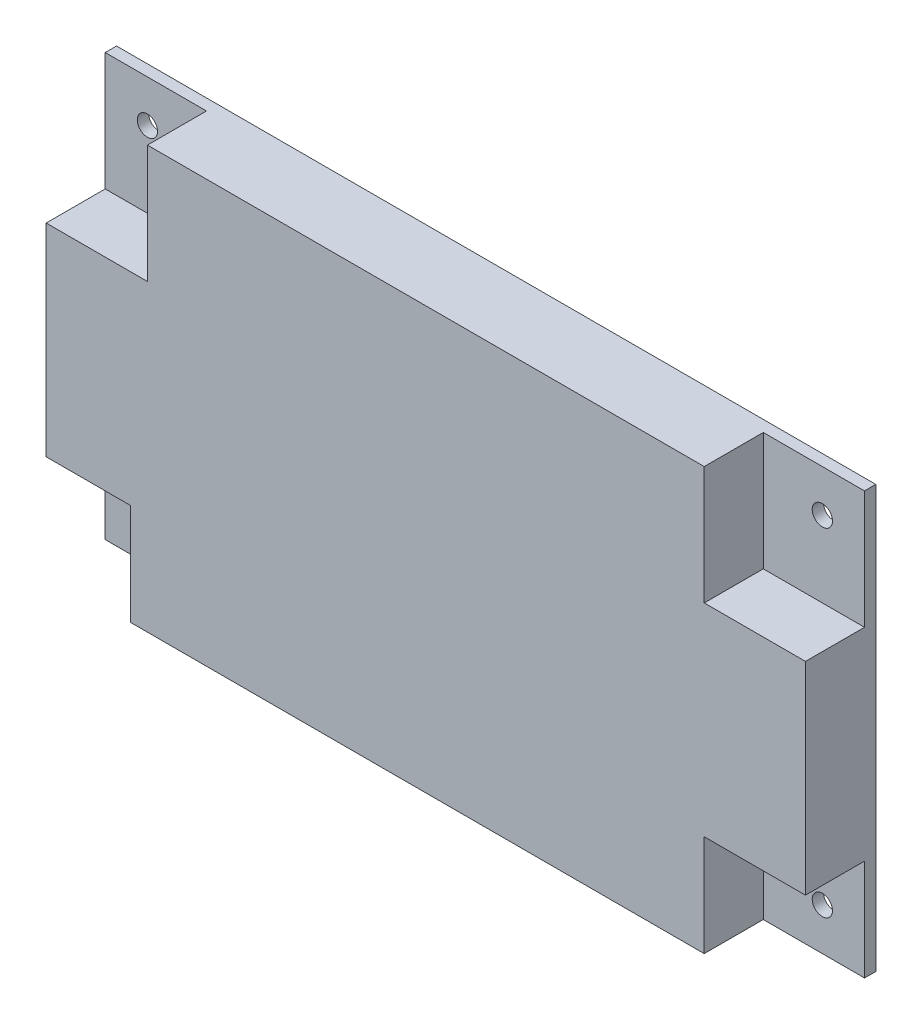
ISO-10303-21;
HEADER;
FILE_DESCRIPTION(('STEP AP214'),'2;1');
FILE_NAME('part.step','',(''),(''),'','','');
FILE_SCHEMA(('AUTOMOTIVE_DESIGN { 1 0 10303 214 1 1 1 1 }'));
ENDSEC;
DATA;
#1=APPLICATION_CONTEXT('core data for automotive mechanical design processes');
#2=APPLICATION_PROTOCOL_DEFINITION('international standard','automotive_design',2000,#1);
#3=PRODUCT_CONTEXT('',#1,'mechanical');
#4=PRODUCT('Part','Part','',(#3));
#5=PRODUCT_RELATED_PRODUCT_CATEGORY('part','',(#4));
#6=PRODUCT_DEFINITION_FORMATION('','',#4);
#7=PRODUCT_DEFINITION_CONTEXT('part definition',#1,'design');
#8=PRODUCT_DEFINITION('design','',#6,#7);
#9=PRODUCT_DEFINITION_SHAPE('','',#8);
#10=(LENGTH_UNIT() NAMED_UNIT(*) SI_UNIT(.MILLI.,.METRE.));
#11=(NAMED_UNIT(*) PLANE_ANGLE_UNIT() SI_UNIT($,.RADIAN.));
#12=(NAMED_UNIT(*) SI_UNIT($,.STERADIAN.) SOLID_ANGLE_UNIT());
#13=UNCERTAINTY_MEASURE_WITH_UNIT(LENGTH_MEASURE(1.E-05),#10,'distance_accuracy_value','');
#14=(GEOMETRIC_REPRESENTATION_CONTEXT(3) GLOBAL_UNCERTAINTY_ASSIGNED_CONTEXT((#13)) GLOBAL_UNIT_ASSIGNED_CONTEXT((#10,
#11,#12)) REPRESENTATION_CONTEXT('',''));
#15=CARTESIAN_POINT('',(0.,0.,0.));
#16=DIRECTION('',(0.,0.,1.));
#17=DIRECTION('',(1.,0.,0.));
#18=AXIS2_PLACEMENT_3D('',#15,#16,#17);
#19=CARTESIAN_POINT('',(2.22044604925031E-13,63.5000000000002,1.70179999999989));
#20=DIRECTION('',(0.,0.,-1.));
#21=DIRECTION('',(-1.,0.,0.));
#22=AXIS2_PLACEMENT_3D('',#19,#20,#21);
#23=PLANE('',#22);
#24=CARTESIAN_POINT('',(107.95,6.35000000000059,1.70179999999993));
#25=DIRECTION('',(0.,0.,1.));
#26=DIRECTION('',(1.,0.,0.));
#27=AXIS2_PLACEMENT_3D('',#24,#25,#26);
#28=CIRCLE('',#27,1.52399999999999);
#29=CARTESIAN_POINT('',(109.474,6.3500000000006,1.70179999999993));
#30=VERTEX_POINT('',#29);
#31=EDGE_CURVE('E181',#30,#30,#28,.T.);
#32=ORIENTED_EDGE('',*,*,#31,.F.);
#33=EDGE_LOOP('',(#32));
#34=FACE_BOUND('',#33,.T.);
#35=DIRECTION('',(1.,0.,0.));
#36=VECTOR('',#35,1.);
#37=CARTESIAN_POINT('',(114.3,15.2400000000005,1.70179999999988));
#38=LINE('',#37,#36);
#39=CARTESIAN_POINT('',(99.0600000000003,15.2400000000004,1.70179999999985));
#40=VERTEX_POINT('',#39);
#41=CARTESIAN_POINT('',(114.3,15.2400000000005,1.70179999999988));
#42=VERTEX_POINT('',#41);
#43=EDGE_CURVE('E43',#40,#42,#38,.T.);
#44=ORIENTED_EDGE('',*,*,#43,.F.);
#45=DIRECTION('',(0.,1.,0.));
#46=VECTOR('',#45,1.);
#47=CARTESIAN_POINT('',(99.0600000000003,15.2400000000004,1.70179999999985));
#48=LINE('',#47,#46);
#49=CARTESIAN_POINT('',(99.0600000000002,4.3454823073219E-13,1.70179999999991));
#50=VERTEX_POINT('',#49);
#51=EDGE_CURVE('E252',#50,#40,#48,.T.);
#52=ORIENTED_EDGE('',*,*,#51,.F.);
#53=DIRECTION('',(1.,0.,0.));
#54=VECTOR('',#53,1.);
#55=CARTESIAN_POINT('',(0.,0.,1.7018));
#56=LINE('',#55,#54);
#57=CARTESIAN_POINT('',(114.3,5.49039980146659E-13,1.7018));
#58=VERTEX_POINT('',#57);
#59=EDGE_CURVE('E215',#50,#58,#56,.T.);
#60=ORIENTED_EDGE('',*,*,#59,.T.);
#61=DIRECTION('',(0.,1.,0.));
#62=VECTOR('',#61,1.);
#63=CARTESIAN_POINT('',(114.3,5.49039980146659E-13,1.7018));
#64=LINE('',#63,#62);
#65=EDGE_CURVE('E234',#58,#42,#64,.T.);
#66=ORIENTED_EDGE('',*,*,#65,.T.);
#67=EDGE_LOOP('',(#44,#52,#60,#66));
#68=FACE_BOUND('',#67,.T.);
#69=ADVANCED_FACE('F26',(#34,#68),#23,.F.);
#70=CARTESIAN_POINT('',(6.34999999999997,6.35000000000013,1.7018));
#71=DIRECTION('',(0.,0.,1.));
#72=DIRECTION('',(1.,0.,0.));
#73=AXIS2_PLACEMENT_3D('',#70,#71,#72);
#74=CIRCLE('',#73,1.524);
#75=CARTESIAN_POINT('',(7.87399999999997,6.35000000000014,1.7018));
#76=VERTEX_POINT('',#75);
#77=EDGE_CURVE('E175',#76,#76,#74,.T.);
#78=ORIENTED_EDGE('',*,*,#77,.F.);
#79=EDGE_LOOP('',(#78));
#80=FACE_BOUND('',#79,.T.);
#81=DIRECTION('',(0.,-1.,0.));
#82=VECTOR('',#81,1.);
#83=CARTESIAN_POINT('',(12.6999999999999,0.,1.70180000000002));
#84=LINE('',#83,#82);
#85=CARTESIAN_POINT('',(12.7000000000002,15.2400000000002,1.70179999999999));
#86=VERTEX_POINT('',#85);
#87=CARTESIAN_POINT('',(12.6999999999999,0.,1.70180000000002));
#88=VERTEX_POINT('',#87);
#89=EDGE_CURVE('E51',#86,#88,#84,.T.);
#90=ORIENTED_EDGE('',*,*,#89,.F.);
#91=DIRECTION('',(1.,0.,0.));
#92=VECTOR('',#91,1.);
#93=CARTESIAN_POINT('',(12.7000000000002,15.2400000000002,1.70179999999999));
#94=LINE('',#93,#92);
#95=CARTESIAN_POINT('',(0.,15.2399999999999,1.70179999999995));
#96=VERTEX_POINT('',#95);
#97=EDGE_CURVE('E253',#96,#86,#94,.T.);
#98=ORIENTED_EDGE('',*,*,#97,.F.);
#99=DIRECTION('',(0.,-1.,0.));
#100=VECTOR('',#99,1.);
#101=CARTESIAN_POINT('',(0.,0.,1.7018));
#102=LINE('',#101,#100);
#103=CARTESIAN_POINT('',(0.,0.,1.7018));
#104=VERTEX_POINT('',#103);
#105=EDGE_CURVE('E205',#96,#104,#102,.T.);
#106=ORIENTED_EDGE('',*,*,#105,.T.);
#107=EDGE_CURVE('E235',#104,#88,#56,.T.);
#108=ORIENTED_EDGE('',*,*,#107,.T.);
#109=EDGE_LOOP('',(#90,#98,#106,#108));
#110=FACE_BOUND('',#109,.T.);
#111=ADVANCED_FACE('F238',(#80,#110),#23,.F.);
#112=CARTESIAN_POINT('',(6.35000000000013,57.1500000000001,1.70179999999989));
#113=DIRECTION('',(0.,0.,1.));
#114=DIRECTION('',(1.,0.,0.));
#115=AXIS2_PLACEMENT_3D('',#112,#113,#114);
#116=CIRCLE('',#115,1.524);
#117=CARTESIAN_POINT('',(7.87400000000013,57.1500000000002,1.70179999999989));
#118=VERTEX_POINT('',#117);
#119=EDGE_CURVE('E193',#118,#118,#116,.T.);
#120=ORIENTED_EDGE('',*,*,#119,.F.);
#121=EDGE_LOOP('',(#120));
#122=FACE_BOUND('',#121,.T.);
#123=DIRECTION('',(-1.,0.,0.));
#124=VECTOR('',#123,1.);
#125=CARTESIAN_POINT('',(1.11022302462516E-13,45.7200000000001,1.70179999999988));
#126=LINE('',#125,#124);
#127=CARTESIAN_POINT('',(15.2400000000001,45.7200000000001,1.70179999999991));
#128=VERTEX_POINT('',#127);
#129=CARTESIAN_POINT('',(1.11022302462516E-13,45.7200000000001,1.70179999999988));
#130=VERTEX_POINT('',#129);
#131=EDGE_CURVE('E270',#128,#130,#126,.T.);
#132=ORIENTED_EDGE('',*,*,#131,.F.);
#133=DIRECTION('',(0.,-1.,0.));
#134=VECTOR('',#133,1.);
#135=CARTESIAN_POINT('',(15.2400000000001,45.7200000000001,1.70179999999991));
#136=LINE('',#135,#134);
#137=CARTESIAN_POINT('',(15.2400000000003,63.5000000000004,1.70179999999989));
#138=VERTEX_POINT('',#137);
#139=EDGE_CURVE('E151',#138,#128,#136,.T.);
#140=ORIENTED_EDGE('',*,*,#139,.F.);
#141=DIRECTION('',(-1.,0.,0.));
#142=VECTOR('',#141,1.);
#143=CARTESIAN_POINT('',(2.22044604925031E-13,63.5000000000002,1.70179999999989));
#144=LINE('',#143,#142);
#145=CARTESIAN_POINT('',(2.22044604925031E-13,63.5000000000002,1.70179999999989));
#146=VERTEX_POINT('',#145);
#147=EDGE_CURVE('E229',#138,#146,#144,.T.);
#148=ORIENTED_EDGE('',*,*,#147,.T.);
#149=EDGE_CURVE('E214',#146,#130,#102,.T.);
#150=ORIENTED_EDGE('',*,*,#149,.T.);
#151=EDGE_LOOP('',(#132,#140,#148,#150));
#152=FACE_BOUND('',#151,.T.);
#153=ADVANCED_FACE('F374',(#122,#152),#23,.F.);
#154=CARTESIAN_POINT('',(107.950000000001,57.1500000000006,1.70179999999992));
#155=DIRECTION('',(0.,0.,1.));
#156=DIRECTION('',(1.,0.,0.));
#157=AXIS2_PLACEMENT_3D('',#154,#155,#156);
#158=CIRCLE('',#157,1.52399999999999);
#159=CARTESIAN_POINT('',(109.474000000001,57.1500000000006,1.70179999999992));
#160=VERTEX_POINT('',#159);
#161=EDGE_CURVE('E187',#160,#160,#158,.T.);
#162=ORIENTED_EDGE('',*,*,#161,.F.);
#163=EDGE_LOOP('',(#162));
#164=FACE_BOUND('',#163,.T.);
#165=DIRECTION('',(0.,1.,0.));
#166=VECTOR('',#165,1.);
#167=CARTESIAN_POINT('',(99.0600000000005,63.5000000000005,1.70179999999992));
#168=LINE('',#167,#166);
#169=CARTESIAN_POINT('',(99.0600000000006,45.7200000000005,1.70179999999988));
#170=VERTEX_POINT('',#169);
#171=CARTESIAN_POINT('',(99.0600000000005,63.5000000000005,1.70179999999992));
#172=VERTEX_POINT('',#171);
#173=EDGE_CURVE('E140',#170,#172,#168,.T.);
#174=ORIENTED_EDGE('',*,*,#173,.F.);
#175=DIRECTION('',(-1.,0.,0.));
#176=VECTOR('',#175,1.);
#177=CARTESIAN_POINT('',(99.0600000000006,45.7200000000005,1.70179999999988));
#178=LINE('',#177,#176);
#179=CARTESIAN_POINT('',(114.300000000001,45.7200000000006,1.70179999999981));
#180=VERTEX_POINT('',#179);
#181=EDGE_CURVE('E143',#180,#170,#178,.T.);
#182=ORIENTED_EDGE('',*,*,#181,.F.);
#183=CARTESIAN_POINT('',(114.300000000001,63.5000000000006,1.70179999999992));
#184=VERTEX_POINT('',#183);
#185=EDGE_CURVE('E232',#180,#184,#64,.T.);
#186=ORIENTED_EDGE('',*,*,#185,.T.);
#187=EDGE_CURVE('E146',#184,#172,#144,.T.);
#188=ORIENTED_EDGE('',*,*,#187,.T.);
#189=EDGE_LOOP('',(#174,#182,#186,#188));
#190=FACE_BOUND('',#189,.T.);
#191=ADVANCED_FACE('F142',(#164,#190),#23,.F.);
#192=CARTESIAN_POINT('',(1.66533453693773E-13,63.5000000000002,0.));
#193=DIRECTION('',(0.,0.,-1.));
#194=DIRECTION('',(-1.,0.,0.));
#195=AXIS2_PLACEMENT_3D('',#192,#193,#194);
#196=PLANE('',#195);
#197=CARTESIAN_POINT('',(107.95,6.3500000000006,0.));
#198=DIRECTION('',(0.,0.,1.));
#199=DIRECTION('',(1.,0.,0.));
#200=AXIS2_PLACEMENT_3D('',#197,#198,#199);
#201=CIRCLE('',#200,1.52399999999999);
#202=CARTESIAN_POINT('',(109.474,6.3500000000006,0.));
#203=VERTEX_POINT('',#202);
#204=EDGE_CURVE('E178',#203,#203,#201,.T.);
#205=ORIENTED_EDGE('',*,*,#204,.T.);
#206=EDGE_LOOP('',(#205));
#207=FACE_BOUND('',#206,.T.);
#208=CARTESIAN_POINT('',(6.35000000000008,57.1500000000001,0.));
#209=DIRECTION('',(0.,0.,1.));
#210=DIRECTION('',(1.,0.,0.));
#211=AXIS2_PLACEMENT_3D('',#208,#209,#210);
#212=CIRCLE('',#211,1.524);
#213=CARTESIAN_POINT('',(7.87400000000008,57.1500000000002,0.));
#214=VERTEX_POINT('',#213);
#215=EDGE_CURVE('E190',#214,#214,#212,.T.);
#216=ORIENTED_EDGE('',*,*,#215,.T.);
#217=EDGE_LOOP('',(#216));
#218=FACE_BOUND('',#217,.T.);
#219=DIRECTION('',(0.,-1.,0.));
#220=VECTOR('',#219,1.);
#221=CARTESIAN_POINT('',(0.,0.,0.));
#222=LINE('',#221,#220);
#223=CARTESIAN_POINT('',(1.66533453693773E-13,63.5000000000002,0.));
#224=VERTEX_POINT('',#223);
#225=CARTESIAN_POINT('',(0.,0.,0.));
#226=VERTEX_POINT('',#225);
#227=EDGE_CURVE('E196',#224,#226,#222,.T.);
#228=ORIENTED_EDGE('',*,*,#227,.F.);
#229=DIRECTION('',(-1.,0.,0.));
#230=VECTOR('',#229,1.);
#231=CARTESIAN_POINT('',(1.66533453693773E-13,63.5000000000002,0.));
#232=LINE('',#231,#230);
#233=CARTESIAN_POINT('',(114.300000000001,63.5000000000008,0.));
#234=VERTEX_POINT('',#233);
#235=EDGE_CURVE('E203',#234,#224,#232,.T.);
#236=ORIENTED_EDGE('',*,*,#235,.F.);
#237=DIRECTION('',(0.,1.,0.));
#238=VECTOR('',#237,1.);
#239=CARTESIAN_POINT('',(114.3,5.52509427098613E-13,0.));
#240=LINE('',#239,#238);
#241=CARTESIAN_POINT('',(114.3,5.52509427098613E-13,0.));
#242=VERTEX_POINT('',#241);
#243=EDGE_CURVE('E201',#242,#234,#240,.T.);
#244=ORIENTED_EDGE('',*,*,#243,.F.);
#245=DIRECTION('',(1.,0.,0.));
#246=VECTOR('',#245,1.);
#247=CARTESIAN_POINT('',(0.,0.,0.));
#248=LINE('',#247,#246);
#249=EDGE_CURVE('E199',#226,#242,#248,.T.);
#250=ORIENTED_EDGE('',*,*,#249,.F.);
#251=EDGE_LOOP('',(#228,#236,#244,#250));
#252=FACE_BOUND('',#251,.T.);
#253=CARTESIAN_POINT('',(107.95,57.1500000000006,0.));
#254=DIRECTION('',(0.,0.,1.));
#255=DIRECTION('',(1.,0.,0.));
#256=AXIS2_PLACEMENT_3D('',#253,#254,#255);
#257=CIRCLE('',#256,1.52399999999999);
#258=CARTESIAN_POINT('',(109.474,57.1500000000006,0.));
#259=VERTEX_POINT('',#258);
#260=EDGE_CURVE('E184',#259,#259,#257,.T.);
#261=ORIENTED_EDGE('',*,*,#260,.T.);
#262=EDGE_LOOP('',(#261));
#263=FACE_BOUND('',#262,.T.);
#264=CARTESIAN_POINT('',(6.34999999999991,6.35000000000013,0.));
#265=DIRECTION('',(0.,0.,1.));
#266=DIRECTION('',(1.,0.,0.));
#267=AXIS2_PLACEMENT_3D('',#264,#265,#266);
#268=CIRCLE('',#267,1.524);
#269=CARTESIAN_POINT('',(7.87399999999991,6.35000000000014,0.));
#270=VERTEX_POINT('',#269);
#271=EDGE_CURVE('E166',#270,#270,#268,.T.);
#272=ORIENTED_EDGE('',*,*,#271,.T.);
#273=EDGE_LOOP('',(#272));
#274=FACE_BOUND('',#273,.T.);
#275=ADVANCED_FACE('F370',(#207,#218,#252,#263,#274),#196,.T.);
#276=CARTESIAN_POINT('',(0.,0.,1.7018));
#277=DIRECTION('',(1.,0.,0.));
#278=DIRECTION('',(0.,0.,-1.));
#279=AXIS2_PLACEMENT_3D('',#276,#277,#278);
#280=PLANE('',#279);
#281=ORIENTED_EDGE('',*,*,#227,.T.);
#282=DIRECTION('',(0.,0.,-1.));
#283=VECTOR('',#282,1.);
#284=CARTESIAN_POINT('',(0.,0.,1.7018));
#285=LINE('',#284,#283);
#286=EDGE_CURVE('E11',#104,#226,#285,.T.);
#287=ORIENTED_EDGE('',*,*,#286,.F.);
#288=ORIENTED_EDGE('',*,*,#105,.F.);
#289=DIRECTION('',(0.,0.,-1.));
#290=VECTOR('',#289,1.);
#291=CARTESIAN_POINT('',(0.,15.24,10.5917999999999));
#292=LINE('',#291,#290);
#293=CARTESIAN_POINT('',(0.,15.24,10.5917999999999));
#294=VERTEX_POINT('',#293);
#295=EDGE_CURVE('E260',#294,#96,#292,.T.);
#296=ORIENTED_EDGE('',*,*,#295,.F.);
#297=DIRECTION('',(0.,-1.,0.));
#298=VECTOR('',#297,1.);
#299=CARTESIAN_POINT('',(0.,15.24,10.5917999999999));
#300=LINE('',#299,#298);
#301=CARTESIAN_POINT('',(0.,45.7200000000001,10.5917999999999));
#302=VERTEX_POINT('',#301);
#303=EDGE_CURVE('E324',#302,#294,#300,.T.);
#304=ORIENTED_EDGE('',*,*,#303,.F.);
#305=DIRECTION('',(0.,0.,-1.));
#306=VECTOR('',#305,1.);
#307=CARTESIAN_POINT('',(0.,45.7200000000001,10.5917999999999));
#308=LINE('',#307,#306);
#309=EDGE_CURVE('E275',#302,#130,#308,.T.);
#310=ORIENTED_EDGE('',*,*,#309,.T.);
#311=ORIENTED_EDGE('',*,*,#149,.F.);
#312=DIRECTION('',(0.,0.,-1.));
#313=VECTOR('',#312,1.);
#314=CARTESIAN_POINT('',(2.22044604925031E-13,63.5000000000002,1.70179999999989));
#315=LINE('',#314,#313);
#316=EDGE_CURVE('E222',#146,#224,#315,.T.);
#317=ORIENTED_EDGE('',*,*,#316,.T.);
#318=EDGE_LOOP('',(#281,#287,#288,#296,#304,#310,#311,#317));
#319=FACE_BOUND('',#318,.T.);
#320=ADVANCED_FACE('F28',(#319),#280,.F.);
#321=CARTESIAN_POINT('',(0.,0.,1.7018));
#322=DIRECTION('',(0.,1.,0.));
#323=DIRECTION('',(0.,0.,1.));
#324=AXIS2_PLACEMENT_3D('',#321,#322,#323);
#325=PLANE('',#324);
#326=ORIENTED_EDGE('',*,*,#249,.T.);
#327=DIRECTION('',(0.,0.,-1.));
#328=VECTOR('',#327,1.);
#329=CARTESIAN_POINT('',(114.3,5.49039980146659E-13,1.7018));
#330=LINE('',#329,#328);
#331=EDGE_CURVE('E35',#58,#242,#330,.T.);
#332=ORIENTED_EDGE('',*,*,#331,.F.);
#333=ORIENTED_EDGE('',*,*,#59,.F.);
#334=DIRECTION('',(0.,0.,-1.));
#335=VECTOR('',#334,1.);
#336=CARTESIAN_POINT('',(99.0600000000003,6.1409211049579E-13,10.5917999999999));
#337=LINE('',#336,#335);
#338=CARTESIAN_POINT('',(99.0600000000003,6.1409211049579E-13,10.5917999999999));
#339=VERTEX_POINT('',#338);
#340=EDGE_CURVE('E258',#339,#50,#337,.T.);
#341=ORIENTED_EDGE('',*,*,#340,.F.);
#342=DIRECTION('',(1.,0.,0.));
#343=VECTOR('',#342,1.);
#344=CARTESIAN_POINT('',(99.0600000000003,6.1409211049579E-13,10.5917999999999));
#345=LINE('',#344,#343);
#346=CARTESIAN_POINT('',(12.6999999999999,0.,10.5917999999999));
#347=VERTEX_POINT('',#346);
#348=EDGE_CURVE('E257',#347,#339,#345,.T.);
#349=ORIENTED_EDGE('',*,*,#348,.F.);
#350=DIRECTION('',(0.,0.,-1.));
#351=VECTOR('',#350,1.);
#352=CARTESIAN_POINT('',(12.6999999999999,0.,10.5917999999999));
#353=LINE('',#352,#351);
#354=EDGE_CURVE('E248',#347,#88,#353,.T.);
#355=ORIENTED_EDGE('',*,*,#354,.T.);
#356=ORIENTED_EDGE('',*,*,#107,.F.);
#357=ORIENTED_EDGE('',*,*,#286,.T.);
#358=EDGE_LOOP('',(#326,#332,#333,#341,#349,#355,#356,#357));
#359=FACE_BOUND('',#358,.T.);
#360=ADVANCED_FACE('F255',(#359),#325,.F.);
#361=CARTESIAN_POINT('',(114.3,5.49039980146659E-13,1.7018));
#362=DIRECTION('',(-1.,0.,0.));
#363=DIRECTION('',(0.,0.,1.));
#364=AXIS2_PLACEMENT_3D('',#361,#362,#363);
#365=PLANE('',#364);
#366=ORIENTED_EDGE('',*,*,#243,.T.);
#367=DIRECTION('',(0.,0.,-1.));
#368=VECTOR('',#367,1.);
#369=CARTESIAN_POINT('',(114.300000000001,63.5000000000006,1.70179999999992));
#370=LINE('',#369,#368);
#371=EDGE_CURVE('E219',#184,#234,#370,.T.);
#372=ORIENTED_EDGE('',*,*,#371,.F.);
#373=ORIENTED_EDGE('',*,*,#185,.F.);
#374=DIRECTION('',(0.,0.,-1.));
#375=VECTOR('',#374,1.);
#376=CARTESIAN_POINT('',(114.3,45.7200000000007,10.5917999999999));
#377=LINE('',#376,#375);
#378=CARTESIAN_POINT('',(114.3,45.7200000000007,10.5917999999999));
#379=VERTEX_POINT('',#378);
#380=EDGE_CURVE('E160',#379,#180,#377,.T.);
#381=ORIENTED_EDGE('',*,*,#380,.F.);
#382=DIRECTION('',(0.,1.,0.));
#383=VECTOR('',#382,1.);
#384=CARTESIAN_POINT('',(114.3,45.7200000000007,10.5917999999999));
#385=LINE('',#384,#383);
#386=CARTESIAN_POINT('',(114.3,15.2400000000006,10.5917999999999));
#387=VERTEX_POINT('',#386);
#388=EDGE_CURVE('E289',#387,#379,#385,.T.);
#389=ORIENTED_EDGE('',*,*,#388,.F.);
#390=DIRECTION('',(0.,0.,-1.));
#391=VECTOR('',#390,1.);
#392=CARTESIAN_POINT('',(114.3,15.2400000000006,10.5917999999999));
#393=LINE('',#392,#391);
#394=EDGE_CURVE('E295',#387,#42,#393,.T.);
#395=ORIENTED_EDGE('',*,*,#394,.T.);
#396=ORIENTED_EDGE('',*,*,#65,.F.);
#397=ORIENTED_EDGE('',*,*,#331,.T.);
#398=EDGE_LOOP('',(#366,#372,#373,#381,#389,#395,#396,#397));
#399=FACE_BOUND('',#398,.T.);
#400=ADVANCED_FACE('F338',(#399),#365,.F.);
#401=CARTESIAN_POINT('',(2.22044604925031E-13,63.5000000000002,1.70179999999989));
#402=DIRECTION('',(0.,-1.,0.));
#403=DIRECTION('',(0.,0.,-1.));
#404=AXIS2_PLACEMENT_3D('',#401,#402,#403);
#405=PLANE('',#404);
#406=ORIENTED_EDGE('',*,*,#235,.T.);
#407=ORIENTED_EDGE('',*,*,#316,.F.);
#408=ORIENTED_EDGE('',*,*,#147,.F.);
#409=DIRECTION('',(0.,0.,-1.));
#410=VECTOR('',#409,1.);
#411=CARTESIAN_POINT('',(15.2400000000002,63.5000000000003,10.5917999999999));
#412=LINE('',#411,#410);
#413=CARTESIAN_POINT('',(15.2400000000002,63.5000000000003,10.5917999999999));
#414=VERTEX_POINT('',#413);
#415=EDGE_CURVE('E168',#414,#138,#412,.T.);
#416=ORIENTED_EDGE('',*,*,#415,.F.);
#417=DIRECTION('',(-1.,0.,0.));
#418=VECTOR('',#417,1.);
#419=CARTESIAN_POINT('',(15.2400000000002,63.5000000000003,10.5917999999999));
#420=LINE('',#419,#418);
#421=CARTESIAN_POINT('',(99.0600000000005,63.5000000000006,10.5917999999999));
#422=VERTEX_POINT('',#421);
#423=EDGE_CURVE('E330',#422,#414,#420,.T.);
#424=ORIENTED_EDGE('',*,*,#423,.F.);
#425=DIRECTION('',(0.,0.,-1.));
#426=VECTOR('',#425,1.);
#427=CARTESIAN_POINT('',(99.0600000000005,63.5000000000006,10.5917999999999));
#428=LINE('',#427,#426);
#429=EDGE_CURVE('E164',#422,#172,#428,.T.);
#430=ORIENTED_EDGE('',*,*,#429,.T.);
#431=ORIENTED_EDGE('',*,*,#187,.F.);
#432=ORIENTED_EDGE('',*,*,#371,.T.);
#433=EDGE_LOOP('',(#406,#407,#408,#416,#424,#430,#431,#432));
#434=FACE_BOUND('',#433,.T.);
#435=ADVANCED_FACE('F343',(#434),#405,.F.);
#436=CARTESIAN_POINT('',(6.35000000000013,57.1500000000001,1.70179999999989));
#437=DIRECTION('',(0.,0.,-1.));
#438=DIRECTION('',(-1.,0.,0.));
#439=AXIS2_PLACEMENT_3D('',#436,#437,#438);
#440=CYLINDRICAL_SURFACE('',#439,1.524);
#441=ORIENTED_EDGE('',*,*,#119,.T.);
#442=EDGE_LOOP('',(#441));
#443=FACE_BOUND('',#442,.T.);
#444=ORIENTED_EDGE('',*,*,#215,.F.);
#445=EDGE_LOOP('',(#444));
#446=FACE_BOUND('',#445,.T.);
#447=ADVANCED_FACE('F412',(#443,#446),#440,.F.);
#448=CARTESIAN_POINT('',(107.950000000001,57.1500000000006,1.70179999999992));
#449=DIRECTION('',(0.,0.,-1.));
#450=DIRECTION('',(-1.,0.,0.));
#451=AXIS2_PLACEMENT_3D('',#448,#449,#450);
#452=CYLINDRICAL_SURFACE('',#451,1.52399999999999);
#453=ORIENTED_EDGE('',*,*,#161,.T.);
#454=EDGE_LOOP('',(#453));
#455=FACE_BOUND('',#454,.T.);
#456=ORIENTED_EDGE('',*,*,#260,.F.);
#457=EDGE_LOOP('',(#456));
#458=FACE_BOUND('',#457,.T.);
#459=ADVANCED_FACE('F404',(#455,#458),#452,.F.);
#460=CARTESIAN_POINT('',(107.95,6.35000000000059,1.70179999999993));
#461=DIRECTION('',(0.,0.,-1.));
#462=DIRECTION('',(-1.,0.,0.));
#463=AXIS2_PLACEMENT_3D('',#460,#461,#462);
#464=CYLINDRICAL_SURFACE('',#463,1.52399999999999);
#465=ORIENTED_EDGE('',*,*,#31,.T.);
#466=EDGE_LOOP('',(#465));
#467=FACE_BOUND('',#466,.T.);
#468=ORIENTED_EDGE('',*,*,#204,.F.);
#469=EDGE_LOOP('',(#468));
#470=FACE_BOUND('',#469,.T.);
#471=ADVANCED_FACE('F400',(#467,#470),#464,.F.);
#472=CARTESIAN_POINT('',(6.34999999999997,6.35000000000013,1.7018));
#473=DIRECTION('',(0.,0.,-1.));
#474=DIRECTION('',(-1.,0.,0.));
#475=AXIS2_PLACEMENT_3D('',#472,#473,#474);
#476=CYLINDRICAL_SURFACE('',#475,1.524);
#477=ORIENTED_EDGE('',*,*,#77,.T.);
#478=EDGE_LOOP('',(#477));
#479=FACE_BOUND('',#478,.T.);
#480=ORIENTED_EDGE('',*,*,#271,.F.);
#481=EDGE_LOOP('',(#480));
#482=FACE_BOUND('',#481,.T.);
#483=ADVANCED_FACE('F403',(#479,#482),#476,.F.);
#484=CARTESIAN_POINT('',(99.0600000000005,45.7200000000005,10.5917999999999));
#485=DIRECTION('',(0.,-1.,0.));
#486=DIRECTION('',(1.,0.,0.));
#487=AXIS2_PLACEMENT_3D('',#484,#485,#486);
#488=PLANE('',#487);
#489=ORIENTED_EDGE('',*,*,#181,.T.);
#490=DIRECTION('',(0.,0.,-1.));
#491=VECTOR('',#490,1.);
#492=CARTESIAN_POINT('',(99.0600000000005,45.7200000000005,10.5917999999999));
#493=LINE('',#492,#491);
#494=CARTESIAN_POINT('',(99.0600000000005,45.7200000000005,10.5917999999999));
#495=VERTEX_POINT('',#494);
#496=EDGE_CURVE('E157',#495,#170,#493,.T.);
#497=ORIENTED_EDGE('',*,*,#496,.F.);
#498=DIRECTION('',(-1.,0.,0.));
#499=VECTOR('',#498,1.);
#500=CARTESIAN_POINT('',(99.0600000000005,45.7200000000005,10.5917999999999));
#501=LINE('',#500,#499);
#502=EDGE_CURVE('E332',#379,#495,#501,.T.);
#503=ORIENTED_EDGE('',*,*,#502,.F.);
#504=ORIENTED_EDGE('',*,*,#380,.T.);
#505=EDGE_LOOP('',(#489,#497,#503,#504));
#506=FACE_BOUND('',#505,.T.);
#507=ADVANCED_FACE('F156',(#506),#488,.F.);
#508=CARTESIAN_POINT('',(99.0600000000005,63.5000000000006,10.5917999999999));
#509=DIRECTION('',(-1.,0.,0.));
#510=DIRECTION('',(0.,-1.,0.));
#511=AXIS2_PLACEMENT_3D('',#508,#509,#510);
#512=PLANE('',#511);
#513=ORIENTED_EDGE('',*,*,#173,.T.);
#514=ORIENTED_EDGE('',*,*,#429,.F.);
#515=DIRECTION('',(0.,1.,0.));
#516=VECTOR('',#515,1.);
#517=CARTESIAN_POINT('',(99.0600000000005,63.5000000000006,10.5917999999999));
#518=LINE('',#517,#516);
#519=EDGE_CURVE('E163',#495,#422,#518,.T.);
#520=ORIENTED_EDGE('',*,*,#519,.F.);
#521=ORIENTED_EDGE('',*,*,#496,.T.);
#522=EDGE_LOOP('',(#513,#514,#520,#521));
#523=FACE_BOUND('',#522,.T.);
#524=ADVANCED_FACE('F162',(#523),#512,.F.);
#525=CARTESIAN_POINT('',(15.2400000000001,45.7200000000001,10.5917999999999));
#526=DIRECTION('',(1.,0.,0.));
#527=DIRECTION('',(0.,1.,0.));
#528=AXIS2_PLACEMENT_3D('',#525,#526,#527);
#529=PLANE('',#528);
#530=ORIENTED_EDGE('',*,*,#139,.T.);
#531=DIRECTION('',(0.,0.,-1.));
#532=VECTOR('',#531,1.);
#533=CARTESIAN_POINT('',(15.2400000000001,45.7200000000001,10.5917999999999));
#534=LINE('',#533,#532);
#535=CARTESIAN_POINT('',(15.2400000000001,45.7200000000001,10.5917999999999));
#536=VERTEX_POINT('',#535);
#537=EDGE_CURVE('E171',#536,#128,#534,.T.);
#538=ORIENTED_EDGE('',*,*,#537,.F.);
#539=DIRECTION('',(0.,-1.,0.));
#540=VECTOR('',#539,1.);
#541=CARTESIAN_POINT('',(15.2400000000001,45.7200000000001,10.5917999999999));
#542=LINE('',#541,#540);
#543=EDGE_CURVE('E328',#414,#536,#542,.T.);
#544=ORIENTED_EDGE('',*,*,#543,.F.);
#545=ORIENTED_EDGE('',*,*,#415,.T.);
#546=EDGE_LOOP('',(#530,#538,#544,#545));
#547=FACE_BOUND('',#546,.T.);
#548=ADVANCED_FACE('F355',(#547),#529,.F.);
#549=CARTESIAN_POINT('',(0.,45.7200000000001,10.5917999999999));
#550=DIRECTION('',(0.,-1.,0.));
#551=DIRECTION('',(0.,0.,-1.));
#552=AXIS2_PLACEMENT_3D('',#549,#550,#551);
#553=PLANE('',#552);
#554=ORIENTED_EDGE('',*,*,#131,.T.);
#555=ORIENTED_EDGE('',*,*,#309,.F.);
#556=DIRECTION('',(-1.,0.,0.));
#557=VECTOR('',#556,1.);
#558=CARTESIAN_POINT('',(0.,45.7200000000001,10.5917999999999));
#559=LINE('',#558,#557);
#560=EDGE_CURVE('E326',#536,#302,#559,.T.);
#561=ORIENTED_EDGE('',*,*,#560,.F.);
#562=ORIENTED_EDGE('',*,*,#537,.T.);
#563=EDGE_LOOP('',(#554,#555,#561,#562));
#564=FACE_BOUND('',#563,.T.);
#565=ADVANCED_FACE('F357',(#564),#553,.F.);
#566=CARTESIAN_POINT('',(12.7,15.24,10.5918));
#567=DIRECTION('',(0.,1.,0.));
#568=DIRECTION('',(-1.,0.,0.));
#569=AXIS2_PLACEMENT_3D('',#566,#567,#568);
#570=PLANE('',#569);
#571=ORIENTED_EDGE('',*,*,#97,.T.);
#572=DIRECTION('',(0.,0.,-1.));
#573=VECTOR('',#572,1.);
#574=CARTESIAN_POINT('',(12.7,15.24,10.5918));
#575=LINE('',#574,#573);
#576=CARTESIAN_POINT('',(12.7,15.24,10.5918));
#577=VERTEX_POINT('',#576);
#578=EDGE_CURVE('E251',#577,#86,#575,.T.);
#579=ORIENTED_EDGE('',*,*,#578,.F.);
#580=DIRECTION('',(1.,0.,0.));
#581=VECTOR('',#580,1.);
#582=CARTESIAN_POINT('',(12.7,15.24,10.5918));
#583=LINE('',#582,#581);
#584=EDGE_CURVE('E322',#294,#577,#583,.T.);
#585=ORIENTED_EDGE('',*,*,#584,.F.);
#586=ORIENTED_EDGE('',*,*,#295,.T.);
#587=EDGE_LOOP('',(#571,#579,#585,#586));
#588=FACE_BOUND('',#587,.T.);
#589=ADVANCED_FACE('F365',(#588),#570,.F.);
#590=CARTESIAN_POINT('',(12.6999999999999,0.,10.5917999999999));
#591=DIRECTION('',(1.,0.,0.));
#592=DIRECTION('',(0.,1.,0.));
#593=AXIS2_PLACEMENT_3D('',#590,#591,#592);
#594=PLANE('',#593);
#595=ORIENTED_EDGE('',*,*,#89,.T.);
#596=ORIENTED_EDGE('',*,*,#354,.F.);
#597=DIRECTION('',(0.,-1.,0.));
#598=VECTOR('',#597,1.);
#599=CARTESIAN_POINT('',(12.6999999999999,0.,10.5917999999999));
#600=LINE('',#599,#598);
#601=EDGE_CURVE('E320',#577,#347,#600,.T.);
#602=ORIENTED_EDGE('',*,*,#601,.F.);
#603=ORIENTED_EDGE('',*,*,#578,.T.);
#604=EDGE_LOOP('',(#595,#596,#602,#603));
#605=FACE_BOUND('',#604,.T.);
#606=ADVANCED_FACE('F246',(#605),#594,.F.);
#607=CARTESIAN_POINT('',(99.0600000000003,15.2400000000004,10.5917999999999));
#608=DIRECTION('',(-1.,0.,0.));
#609=DIRECTION('',(0.,-1.,0.));
#610=AXIS2_PLACEMENT_3D('',#607,#608,#609);
#611=PLANE('',#610);
#612=ORIENTED_EDGE('',*,*,#51,.T.);
#613=DIRECTION('',(0.,0.,-1.));
#614=VECTOR('',#613,1.);
#615=CARTESIAN_POINT('',(99.0600000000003,15.2400000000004,10.5917999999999));
#616=LINE('',#615,#614);
#617=CARTESIAN_POINT('',(99.0600000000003,15.2400000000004,10.5917999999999));
#618=VERTEX_POINT('',#617);
#619=EDGE_CURVE('E262',#618,#40,#616,.T.);
#620=ORIENTED_EDGE('',*,*,#619,.F.);
#621=DIRECTION('',(0.,1.,0.));
#622=VECTOR('',#621,1.);
#623=CARTESIAN_POINT('',(99.0600000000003,15.2400000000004,10.5917999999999));
#624=LINE('',#623,#622);
#625=EDGE_CURVE('E317',#339,#618,#624,.T.);
#626=ORIENTED_EDGE('',*,*,#625,.F.);
#627=ORIENTED_EDGE('',*,*,#340,.T.);
#628=EDGE_LOOP('',(#612,#620,#626,#627));
#629=FACE_BOUND('',#628,.T.);
#630=ADVANCED_FACE('F307',(#629),#611,.F.);
#631=CARTESIAN_POINT('',(114.3,15.2400000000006,10.5917999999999));
#632=DIRECTION('',(0.,1.,0.));
#633=DIRECTION('',(0.,0.,1.));
#634=AXIS2_PLACEMENT_3D('',#631,#632,#633);
#635=PLANE('',#634);
#636=ORIENTED_EDGE('',*,*,#43,.T.);
#637=ORIENTED_EDGE('',*,*,#394,.F.);
#638=DIRECTION('',(1.,0.,0.));
#639=VECTOR('',#638,1.);
#640=CARTESIAN_POINT('',(114.3,15.2400000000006,10.5917999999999));
#641=LINE('',#640,#639);
#642=EDGE_CURVE('E298',#618,#387,#641,.T.);
#643=ORIENTED_EDGE('',*,*,#642,.F.);
#644=ORIENTED_EDGE('',*,*,#619,.T.);
#645=EDGE_LOOP('',(#636,#637,#643,#644));
#646=FACE_BOUND('',#645,.T.);
#647=ADVANCED_FACE('F312',(#646),#635,.F.);
#648=CARTESIAN_POINT('',(114.3,15.2400000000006,10.5917999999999));
#649=DIRECTION('',(0.,0.,-1.));
#650=DIRECTION('',(-1.,0.,0.));
#651=AXIS2_PLACEMENT_3D('',#648,#649,#650);
#652=PLANE('',#651);
#653=ORIENTED_EDGE('',*,*,#388,.T.);
#654=ORIENTED_EDGE('',*,*,#502,.T.);
#655=ORIENTED_EDGE('',*,*,#519,.T.);
#656=ORIENTED_EDGE('',*,*,#423,.T.);
#657=ORIENTED_EDGE('',*,*,#543,.T.);
#658=ORIENTED_EDGE('',*,*,#560,.T.);
#659=ORIENTED_EDGE('',*,*,#303,.T.);
#660=ORIENTED_EDGE('',*,*,#584,.T.);
#661=ORIENTED_EDGE('',*,*,#601,.T.);
#662=ORIENTED_EDGE('',*,*,#348,.T.);
#663=ORIENTED_EDGE('',*,*,#625,.T.);
#664=ORIENTED_EDGE('',*,*,#642,.T.);
#665=EDGE_LOOP('',(#653,#654,#655,#656,#657,#658,#659,#660,#661,#662,#663,#664));
#666=FACE_BOUND('',#665,.T.);
#667=ADVANCED_FACE('F336',(#666),#652,.F.);
#668=CLOSED_SHELL('',(#69,#111,#153,#191,#275,#320,#360,#400,#435,#447,#459,#471,#483,#507,#524,
#548,#565,#589,#606,#630,#647,#667));
#669=MANIFOLD_SOLID_BREP('B2',#668);
#670=ADVANCED_BREP_SHAPE_REPRESENTATION('',(#18,#669),#14);
#671=SHAPE_DEFINITION_REPRESENTATION(#9,#670);
ENDSEC;
END-ISO-10303-21;
